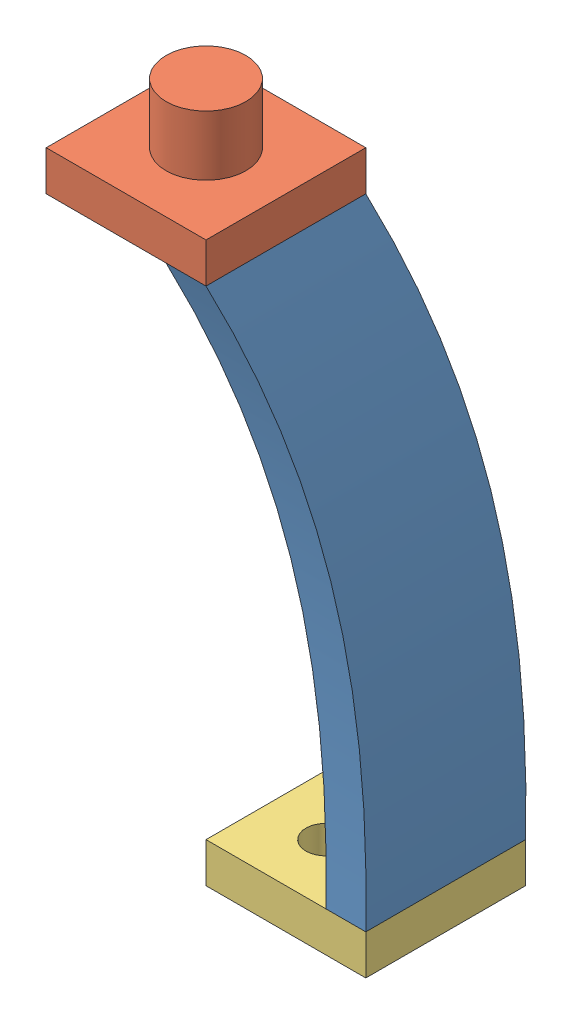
SolidWorks assembly LED Leg.SLDASM, configuration Default (file format 11000). Lengths in mm.
Overall size (19.31 55.56 19.05).
3 component instances, 3 part files, 6 mates.
Components (placement in the parent):
- leg post-1: leg post.SLDPRT [Default] at (11.4414 15.4327 42.1119) size (19.31 44.45 19.05)
- leg_post_top-1: leg_post_top.SLDPRT [Default] at (5.0914 59.8827 48.4619) size (12.7 7.94 12.7)
- leg_post_bottom-1: leg_post_bottom.SLDPRT [Default] at (11.4414 12.2577 42.1119) size (12.7 3.17 12.7)
Mates (geometry in assembly coordinates):
- Coincident1: coincident: plane of leg post-1 through (11.4414 15.4327 42.1119) normal (0 -1 0); plane of leg_post_bottom-1 through (11.4414 15.4327 42.1119) normal (0 1 0)
- Coincident2: coincident: line of leg post-1 through (17.7914 15.4327 35.7619) axis (-1 0 0); plane of leg_post_bottom-1 through (5.0914 15.4327 35.7619) normal (0 0 -1)
- Coincident3: coincident: line of leg post-1 through (17.7914 15.4327 48.4619) axis (0 0 -1); plane of leg_post_bottom-1 through (17.7914 15.4327 48.4619) normal (1 0 0)
- Coincident4: coincident: line of leg post-1 through (11.4414 59.8827 54.8119) axis (0 0 -1); plane of leg_post_top-1 through (11.4414 63.0577 54.8119) normal (1 0 0)
- Coincident5: coincident: line of leg post-1 through (11.4414 59.8827 42.1119) axis (-1 0 0); plane of leg_post_top-1 through (-1.2586 63.0577 42.1119) normal (0 0 -1)
- Coincident6: coincident: plane of leg post-1 through (11.4414 59.8827 42.1119) normal (0 1 0); plane of leg_post_top-1 through (5.0914 59.8827 48.4619) normal (0 -1 0)
